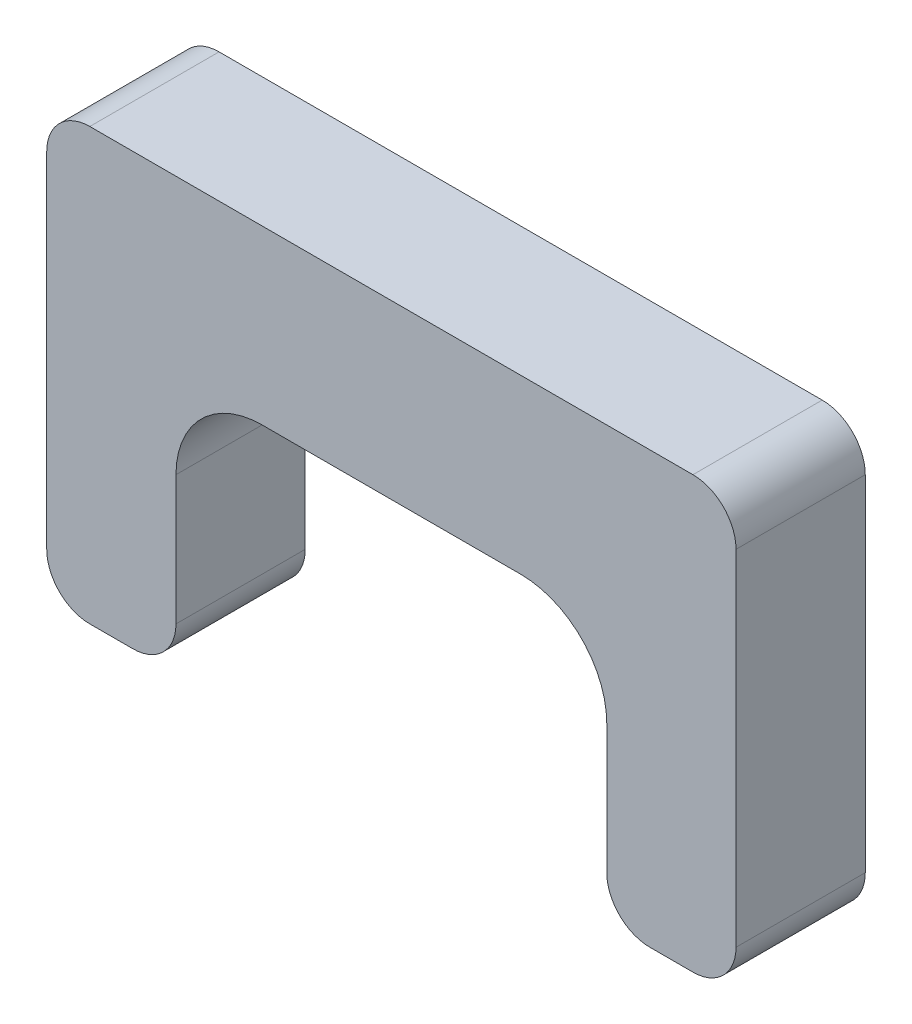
ISO-10303-21;
HEADER;
FILE_DESCRIPTION(('STEP AP214'),'2;1');
FILE_NAME('part.step','',(''),(''),'','','');
FILE_SCHEMA(('AUTOMOTIVE_DESIGN { 1 0 10303 214 1 1 1 1 }'));
ENDSEC;
DATA;
#1=APPLICATION_CONTEXT('core data for automotive mechanical design processes');
#2=APPLICATION_PROTOCOL_DEFINITION('international standard','automotive_design',2000,#1);
#3=PRODUCT_CONTEXT('',#1,'mechanical');
#4=PRODUCT('Part','Part','',(#3));
#5=PRODUCT_RELATED_PRODUCT_CATEGORY('part','',(#4));
#6=PRODUCT_DEFINITION_FORMATION('','',#4);
#7=PRODUCT_DEFINITION_CONTEXT('part definition',#1,'design');
#8=PRODUCT_DEFINITION('design','',#6,#7);
#9=PRODUCT_DEFINITION_SHAPE('','',#8);
#10=(LENGTH_UNIT() NAMED_UNIT(*) SI_UNIT(.MILLI.,.METRE.));
#11=(NAMED_UNIT(*) PLANE_ANGLE_UNIT() SI_UNIT($,.RADIAN.));
#12=(NAMED_UNIT(*) SI_UNIT($,.STERADIAN.) SOLID_ANGLE_UNIT());
#13=UNCERTAINTY_MEASURE_WITH_UNIT(LENGTH_MEASURE(1.E-05),#10,'distance_accuracy_value','');
#14=(GEOMETRIC_REPRESENTATION_CONTEXT(3) GLOBAL_UNCERTAINTY_ASSIGNED_CONTEXT((#13)) GLOBAL_UNIT_ASSIGNED_CONTEXT((#10,
#11,#12)) REPRESENTATION_CONTEXT('',''));
#15=CARTESIAN_POINT('',(0.,0.,0.));
#16=DIRECTION('',(0.,0.,1.));
#17=DIRECTION('',(1.,0.,0.));
#18=AXIS2_PLACEMENT_3D('',#15,#16,#17);
#19=CARTESIAN_POINT('',(-8.,-5.,3.));
#20=DIRECTION('',(0.,1.,0.));
#21=DIRECTION('',(0.,0.,1.));
#22=AXIS2_PLACEMENT_3D('',#19,#20,#21);
#23=PLANE('',#22);
#24=DIRECTION('',(1.,0.,0.));
#25=VECTOR('',#24,1.);
#26=CARTESIAN_POINT('',(-8.,-5.,0.));
#27=LINE('',#26,#25);
#28=CARTESIAN_POINT('',(6.,-5.,0.));
#29=VERTEX_POINT('',#28);
#30=CARTESIAN_POINT('',(7.,-5.,0.));
#31=VERTEX_POINT('',#30);
#32=EDGE_CURVE('E244',#29,#31,#27,.T.);
#33=ORIENTED_EDGE('',*,*,#32,.T.);
#34=DIRECTION('',(0.,0.,-1.));
#35=VECTOR('',#34,1.);
#36=CARTESIAN_POINT('',(7.,-5.,3.));
#37=LINE('',#36,#35);
#38=CARTESIAN_POINT('',(7.,-5.,3.));
#39=VERTEX_POINT('',#38);
#40=EDGE_CURVE('E43',#31,#39,#37,.F.);
#41=ORIENTED_EDGE('',*,*,#40,.T.);
#42=DIRECTION('',(1.,0.,0.));
#43=VECTOR('',#42,1.);
#44=CARTESIAN_POINT('',(-8.,-5.,3.));
#45=LINE('',#44,#43);
#46=CARTESIAN_POINT('',(6.,-5.,3.));
#47=VERTEX_POINT('',#46);
#48=EDGE_CURVE('E241',#47,#39,#45,.T.);
#49=ORIENTED_EDGE('',*,*,#48,.F.);
#50=DIRECTION('',(0.,0.,-1.));
#51=VECTOR('',#50,1.);
#52=CARTESIAN_POINT('',(6.,-5.,3.));
#53=LINE('',#52,#51);
#54=EDGE_CURVE('E235',#47,#29,#53,.T.);
#55=ORIENTED_EDGE('',*,*,#54,.T.);
#56=EDGE_LOOP('',(#33,#41,#49,#55));
#57=FACE_BOUND('',#56,.T.);
#58=ADVANCED_FACE('F35',(#57),#23,.F.);
#59=CARTESIAN_POINT('',(8.,5.,3.));
#60=DIRECTION('',(-1.,0.,0.));
#61=DIRECTION('',(0.,0.,1.));
#62=AXIS2_PLACEMENT_3D('',#59,#60,#61);
#63=PLANE('',#62);
#64=DIRECTION('',(0.,1.,0.));
#65=VECTOR('',#64,1.);
#66=CARTESIAN_POINT('',(8.,5.,3.));
#67=LINE('',#66,#65);
#68=CARTESIAN_POINT('',(8.,-4.,3.));
#69=VERTEX_POINT('',#68);
#70=CARTESIAN_POINT('',(8.,4.,3.));
#71=VERTEX_POINT('',#70);
#72=EDGE_CURVE('E259',#69,#71,#67,.T.);
#73=ORIENTED_EDGE('',*,*,#72,.F.);
#74=DIRECTION('',(0.,0.,-1.));
#75=VECTOR('',#74,1.);
#76=CARTESIAN_POINT('',(8.,-4.,3.));
#77=LINE('',#76,#75);
#78=CARTESIAN_POINT('',(8.,-4.,0.));
#79=VERTEX_POINT('',#78);
#80=EDGE_CURVE('E233',#69,#79,#77,.T.);
#81=ORIENTED_EDGE('',*,*,#80,.T.);
#82=DIRECTION('',(0.,1.,0.));
#83=VECTOR('',#82,1.);
#84=CARTESIAN_POINT('',(8.,5.,0.));
#85=LINE('',#84,#83);
#86=CARTESIAN_POINT('',(8.,4.,0.));
#87=VERTEX_POINT('',#86);
#88=EDGE_CURVE('E170',#79,#87,#85,.T.);
#89=ORIENTED_EDGE('',*,*,#88,.T.);
#90=DIRECTION('',(0.,0.,-1.));
#91=VECTOR('',#90,1.);
#92=CARTESIAN_POINT('',(8.,4.,3.));
#93=LINE('',#92,#91);
#94=EDGE_CURVE('E231',#87,#71,#93,.F.);
#95=ORIENTED_EDGE('',*,*,#94,.T.);
#96=EDGE_LOOP('',(#73,#81,#89,#95));
#97=FACE_BOUND('',#96,.T.);
#98=ADVANCED_FACE('F257',(#97),#63,.F.);
#99=CARTESIAN_POINT('',(-8.,5.,3.));
#100=DIRECTION('',(0.,-1.,0.));
#101=DIRECTION('',(0.,0.,-1.));
#102=AXIS2_PLACEMENT_3D('',#99,#100,#101);
#103=PLANE('',#102);
#104=DIRECTION('',(-1.,0.,0.));
#105=VECTOR('',#104,1.);
#106=CARTESIAN_POINT('',(-8.,5.,0.));
#107=LINE('',#106,#105);
#108=CARTESIAN_POINT('',(7.,5.,0.));
#109=VERTEX_POINT('',#108);
#110=CARTESIAN_POINT('',(-7.,5.,0.));
#111=VERTEX_POINT('',#110);
#112=EDGE_CURVE('E260',#109,#111,#107,.T.);
#113=ORIENTED_EDGE('',*,*,#112,.T.);
#114=DIRECTION('',(0.,0.,-1.));
#115=VECTOR('',#114,1.);
#116=CARTESIAN_POINT('',(-7.,5.,3.));
#117=LINE('',#116,#115);
#118=CARTESIAN_POINT('',(-7.,5.,3.));
#119=VERTEX_POINT('',#118);
#120=EDGE_CURVE('E229',#111,#119,#117,.F.);
#121=ORIENTED_EDGE('',*,*,#120,.T.);
#122=DIRECTION('',(-1.,0.,0.));
#123=VECTOR('',#122,1.);
#124=CARTESIAN_POINT('',(-8.,5.,3.));
#125=LINE('',#124,#123);
#126=CARTESIAN_POINT('',(7.,5.,3.));
#127=VERTEX_POINT('',#126);
#128=EDGE_CURVE('E273',#127,#119,#125,.T.);
#129=ORIENTED_EDGE('',*,*,#128,.F.);
#130=DIRECTION('',(0.,0.,-1.));
#131=VECTOR('',#130,1.);
#132=CARTESIAN_POINT('',(7.,5.,3.));
#133=LINE('',#132,#131);
#134=EDGE_CURVE('E226',#127,#109,#133,.T.);
#135=ORIENTED_EDGE('',*,*,#134,.T.);
#136=EDGE_LOOP('',(#113,#121,#129,#135));
#137=FACE_BOUND('',#136,.T.);
#138=ADVANCED_FACE('F327',(#137),#103,.F.);
#139=CARTESIAN_POINT('',(-8.,5.,3.));
#140=DIRECTION('',(1.,0.,0.));
#141=DIRECTION('',(0.,1.,0.));
#142=AXIS2_PLACEMENT_3D('',#139,#140,#141);
#143=PLANE('',#142);
#144=DIRECTION('',(0.,-1.,0.));
#145=VECTOR('',#144,1.);
#146=CARTESIAN_POINT('',(-8.,5.,0.));
#147=LINE('',#146,#145);
#148=CARTESIAN_POINT('',(-8.,4.,0.));
#149=VERTEX_POINT('',#148);
#150=CARTESIAN_POINT('',(-8.,-4.,0.));
#151=VERTEX_POINT('',#150);
#152=EDGE_CURVE('E263',#149,#151,#147,.T.);
#153=ORIENTED_EDGE('',*,*,#152,.T.);
#154=DIRECTION('',(0.,0.,-1.));
#155=VECTOR('',#154,1.);
#156=CARTESIAN_POINT('',(-8.,-4.,3.));
#157=LINE('',#156,#155);
#158=CARTESIAN_POINT('',(-8.,-4.,3.));
#159=VERTEX_POINT('',#158);
#160=EDGE_CURVE('E224',#151,#159,#157,.F.);
#161=ORIENTED_EDGE('',*,*,#160,.T.);
#162=DIRECTION('',(0.,-1.,0.));
#163=VECTOR('',#162,1.);
#164=CARTESIAN_POINT('',(-8.,5.,3.));
#165=LINE('',#164,#163);
#166=CARTESIAN_POINT('',(-8.,4.,3.));
#167=VERTEX_POINT('',#166);
#168=EDGE_CURVE('E253',#167,#159,#165,.T.);
#169=ORIENTED_EDGE('',*,*,#168,.F.);
#170=DIRECTION('',(0.,0.,-1.));
#171=VECTOR('',#170,1.);
#172=CARTESIAN_POINT('',(-8.,4.,3.));
#173=LINE('',#172,#171);
#174=EDGE_CURVE('E221',#167,#149,#173,.T.);
#175=ORIENTED_EDGE('',*,*,#174,.T.);
#176=EDGE_LOOP('',(#153,#161,#169,#175));
#177=FACE_BOUND('',#176,.T.);
#178=ADVANCED_FACE('F332',(#177),#143,.F.);
#179=CARTESIAN_POINT('',(-7.,-5.,0.));
#180=VERTEX_POINT('',#179);
#181=CARTESIAN_POINT('',(-6.,-5.,0.));
#182=VERTEX_POINT('',#181);
#183=EDGE_CURVE('E268',#180,#182,#27,.T.);
#184=ORIENTED_EDGE('',*,*,#183,.T.);
#185=DIRECTION('',(0.,0.,1.));
#186=VECTOR('',#185,1.);
#187=CARTESIAN_POINT('',(-6.,-5.,3.));
#188=LINE('',#187,#186);
#189=CARTESIAN_POINT('',(-6.,-5.,3.));
#190=VERTEX_POINT('',#189);
#191=EDGE_CURVE('E195',#182,#190,#188,.T.);
#192=ORIENTED_EDGE('',*,*,#191,.T.);
#193=CARTESIAN_POINT('',(-7.,-5.,3.));
#194=VERTEX_POINT('',#193);
#195=EDGE_CURVE('E179',#194,#190,#45,.T.);
#196=ORIENTED_EDGE('',*,*,#195,.F.);
#197=DIRECTION('',(0.,0.,-1.));
#198=VECTOR('',#197,1.);
#199=CARTESIAN_POINT('',(-7.,-5.,3.));
#200=LINE('',#199,#198);
#201=EDGE_CURVE('E192',#194,#180,#200,.T.);
#202=ORIENTED_EDGE('',*,*,#201,.T.);
#203=EDGE_LOOP('',(#184,#192,#196,#202));
#204=FACE_BOUND('',#203,.T.);
#205=ADVANCED_FACE('F292',(#204),#23,.F.);
#206=CARTESIAN_POINT('',(0.,0.,3.));
#207=DIRECTION('',(0.,0.,1.));
#208=DIRECTION('',(1.,0.,0.));
#209=AXIS2_PLACEMENT_3D('',#206,#207,#208);
#210=PLANE('',#209);
#211=ORIENTED_EDGE('',*,*,#195,.T.);
#212=CARTESIAN_POINT('',(-6.,-4.,3.));
#213=DIRECTION('',(0.,0.,1.));
#214=DIRECTION('',(1.,0.,0.));
#215=AXIS2_PLACEMENT_3D('',#212,#213,#214);
#216=CIRCLE('',#215,1.);
#217=CARTESIAN_POINT('',(-5.,-4.,3.));
#218=VERTEX_POINT('',#217);
#219=EDGE_CURVE('E208',#190,#218,#216,.T.);
#220=ORIENTED_EDGE('',*,*,#219,.T.);
#221=DIRECTION('',(0.,-1.,0.));
#222=VECTOR('',#221,1.);
#223=CARTESIAN_POINT('',(-5.,-11.,3.));
#224=LINE('',#223,#222);
#225=CARTESIAN_POINT('',(-5.,-0.999999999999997,3.));
#226=VERTEX_POINT('',#225);
#227=EDGE_CURVE('E279',#226,#218,#224,.T.);
#228=ORIENTED_EDGE('',*,*,#227,.F.);
#229=CARTESIAN_POINT('',(-3.,-0.999999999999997,3.));
#230=DIRECTION('',(0.,0.,1.));
#231=DIRECTION('',(1.,0.,0.));
#232=AXIS2_PLACEMENT_3D('',#229,#230,#231);
#233=CIRCLE('',#232,2.);
#234=CARTESIAN_POINT('',(-3.,1.,3.));
#235=VERTEX_POINT('',#234);
#236=EDGE_CURVE('E160',#226,#235,#233,.F.);
#237=ORIENTED_EDGE('',*,*,#236,.T.);
#238=DIRECTION('',(-1.,0.,0.));
#239=VECTOR('',#238,1.);
#240=CARTESIAN_POINT('',(-5.,1.,3.));
#241=LINE('',#240,#239);
#242=CARTESIAN_POINT('',(3.,1.,3.));
#243=VERTEX_POINT('',#242);
#244=EDGE_CURVE('E296',#243,#235,#241,.T.);
#245=ORIENTED_EDGE('',*,*,#244,.F.);
#246=CARTESIAN_POINT('',(3.,-0.999999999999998,3.));
#247=DIRECTION('',(0.,0.,1.));
#248=DIRECTION('',(1.,0.,0.));
#249=AXIS2_PLACEMENT_3D('',#246,#247,#248);
#250=CIRCLE('',#249,2.);
#251=CARTESIAN_POINT('',(5.,-0.999999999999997,3.));
#252=VERTEX_POINT('',#251);
#253=EDGE_CURVE('E159',#243,#252,#250,.F.);
#254=ORIENTED_EDGE('',*,*,#253,.T.);
#255=DIRECTION('',(0.,1.,0.));
#256=VECTOR('',#255,1.);
#257=CARTESIAN_POINT('',(5.,-11.,3.));
#258=LINE('',#257,#256);
#259=CARTESIAN_POINT('',(5.,-4.,3.));
#260=VERTEX_POINT('',#259);
#261=EDGE_CURVE('E299',#260,#252,#258,.T.);
#262=ORIENTED_EDGE('',*,*,#261,.F.);
#263=CARTESIAN_POINT('',(6.,-4.,3.));
#264=DIRECTION('',(0.,0.,1.));
#265=DIRECTION('',(1.,0.,0.));
#266=AXIS2_PLACEMENT_3D('',#263,#264,#265);
#267=CIRCLE('',#266,1.);
#268=EDGE_CURVE('E200',#260,#47,#267,.T.);
#269=ORIENTED_EDGE('',*,*,#268,.T.);
#270=ORIENTED_EDGE('',*,*,#48,.T.);
#271=CARTESIAN_POINT('',(7.,-4.,3.));
#272=DIRECTION('',(0.,0.,1.));
#273=DIRECTION('',(1.,0.,0.));
#274=AXIS2_PLACEMENT_3D('',#271,#272,#273);
#275=CIRCLE('',#274,1.);
#276=EDGE_CURVE('E202',#39,#69,#275,.T.);
#277=ORIENTED_EDGE('',*,*,#276,.T.);
#278=ORIENTED_EDGE('',*,*,#72,.T.);
#279=CARTESIAN_POINT('',(7.,4.,3.));
#280=DIRECTION('',(0.,0.,1.));
#281=DIRECTION('',(1.,0.,0.));
#282=AXIS2_PLACEMENT_3D('',#279,#280,#281);
#283=CIRCLE('',#282,1.);
#284=EDGE_CURVE('E198',#71,#127,#283,.T.);
#285=ORIENTED_EDGE('',*,*,#284,.T.);
#286=ORIENTED_EDGE('',*,*,#128,.T.);
#287=CARTESIAN_POINT('',(-7.,4.,3.));
#288=DIRECTION('',(0.,0.,1.));
#289=DIRECTION('',(1.,0.,0.));
#290=AXIS2_PLACEMENT_3D('',#287,#288,#289);
#291=CIRCLE('',#290,1.);
#292=EDGE_CURVE('E204',#119,#167,#291,.T.);
#293=ORIENTED_EDGE('',*,*,#292,.T.);
#294=ORIENTED_EDGE('',*,*,#168,.T.);
#295=CARTESIAN_POINT('',(-7.,-4.,3.));
#296=DIRECTION('',(0.,0.,1.));
#297=DIRECTION('',(1.,0.,0.));
#298=AXIS2_PLACEMENT_3D('',#295,#296,#297);
#299=CIRCLE('',#298,1.);
#300=EDGE_CURVE('E206',#159,#194,#299,.T.);
#301=ORIENTED_EDGE('',*,*,#300,.T.);
#302=EDGE_LOOP('',(#211,#220,#228,#237,#245,#254,#262,#269,#270,#277,#278,#285,#286,#293,#294,#301));
#303=FACE_BOUND('',#302,.T.);
#304=ADVANCED_FACE('F248',(#303),#210,.T.);
#305=CARTESIAN_POINT('',(0.,0.,0.));
#306=DIRECTION('',(0.,0.,1.));
#307=DIRECTION('',(1.,0.,0.));
#308=AXIS2_PLACEMENT_3D('',#305,#306,#307);
#309=PLANE('',#308);
#310=DIRECTION('',(0.,-1.,0.));
#311=VECTOR('',#310,1.);
#312=CARTESIAN_POINT('',(-5.,-11.,0.));
#313=LINE('',#312,#311);
#314=CARTESIAN_POINT('',(-5.,-0.999999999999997,0.));
#315=VERTEX_POINT('',#314);
#316=CARTESIAN_POINT('',(-5.,-4.,0.));
#317=VERTEX_POINT('',#316);
#318=EDGE_CURVE('E152',#315,#317,#313,.T.);
#319=ORIENTED_EDGE('',*,*,#318,.T.);
#320=CARTESIAN_POINT('',(-6.,-4.,0.));
#321=DIRECTION('',(0.,0.,1.));
#322=DIRECTION('',(1.,0.,0.));
#323=AXIS2_PLACEMENT_3D('',#320,#321,#322);
#324=CIRCLE('',#323,1.);
#325=EDGE_CURVE('E219',#317,#182,#324,.F.);
#326=ORIENTED_EDGE('',*,*,#325,.T.);
#327=ORIENTED_EDGE('',*,*,#183,.F.);
#328=CARTESIAN_POINT('',(-7.,-4.,0.));
#329=DIRECTION('',(0.,0.,1.));
#330=DIRECTION('',(1.,0.,0.));
#331=AXIS2_PLACEMENT_3D('',#328,#329,#330);
#332=CIRCLE('',#331,1.);
#333=EDGE_CURVE('E217',#180,#151,#332,.F.);
#334=ORIENTED_EDGE('',*,*,#333,.T.);
#335=ORIENTED_EDGE('',*,*,#152,.F.);
#336=CARTESIAN_POINT('',(-7.,4.,0.));
#337=DIRECTION('',(0.,0.,1.));
#338=DIRECTION('',(1.,0.,0.));
#339=AXIS2_PLACEMENT_3D('',#336,#337,#338);
#340=CIRCLE('',#339,1.);
#341=EDGE_CURVE('E215',#149,#111,#340,.F.);
#342=ORIENTED_EDGE('',*,*,#341,.T.);
#343=ORIENTED_EDGE('',*,*,#112,.F.);
#344=CARTESIAN_POINT('',(7.,4.,0.));
#345=DIRECTION('',(0.,0.,1.));
#346=DIRECTION('',(1.,0.,0.));
#347=AXIS2_PLACEMENT_3D('',#344,#345,#346);
#348=CIRCLE('',#347,1.);
#349=EDGE_CURVE('E50',#109,#87,#348,.F.);
#350=ORIENTED_EDGE('',*,*,#349,.T.);
#351=ORIENTED_EDGE('',*,*,#88,.F.);
#352=CARTESIAN_POINT('',(7.,-4.,0.));
#353=DIRECTION('',(0.,0.,1.));
#354=DIRECTION('',(1.,0.,0.));
#355=AXIS2_PLACEMENT_3D('',#352,#353,#354);
#356=CIRCLE('',#355,1.);
#357=EDGE_CURVE('E58',#79,#31,#356,.F.);
#358=ORIENTED_EDGE('',*,*,#357,.T.);
#359=ORIENTED_EDGE('',*,*,#32,.F.);
#360=CARTESIAN_POINT('',(6.,-4.,0.));
#361=DIRECTION('',(0.,0.,1.));
#362=DIRECTION('',(1.,0.,0.));
#363=AXIS2_PLACEMENT_3D('',#360,#361,#362);
#364=CIRCLE('',#363,1.);
#365=CARTESIAN_POINT('',(5.,-4.,0.));
#366=VERTEX_POINT('',#365);
#367=EDGE_CURVE('E212',#29,#366,#364,.F.);
#368=ORIENTED_EDGE('',*,*,#367,.T.);
#369=DIRECTION('',(0.,1.,0.));
#370=VECTOR('',#369,1.);
#371=CARTESIAN_POINT('',(5.,0.,0.));
#372=LINE('',#371,#370);
#373=CARTESIAN_POINT('',(5.,-0.999999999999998,0.));
#374=VERTEX_POINT('',#373);
#375=EDGE_CURVE('E174',#366,#374,#372,.T.);
#376=ORIENTED_EDGE('',*,*,#375,.T.);
#377=CARTESIAN_POINT('',(3.,-0.999999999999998,0.));
#378=DIRECTION('',(0.,0.,1.));
#379=DIRECTION('',(1.,0.,0.));
#380=AXIS2_PLACEMENT_3D('',#377,#378,#379);
#381=CIRCLE('',#380,2.);
#382=CARTESIAN_POINT('',(3.,1.,0.));
#383=VERTEX_POINT('',#382);
#384=EDGE_CURVE('E190',#374,#383,#381,.T.);
#385=ORIENTED_EDGE('',*,*,#384,.T.);
#386=DIRECTION('',(-1.,0.,0.));
#387=VECTOR('',#386,1.);
#388=CARTESIAN_POINT('',(-5.,1.,0.));
#389=LINE('',#388,#387);
#390=CARTESIAN_POINT('',(-3.,1.,0.));
#391=VERTEX_POINT('',#390);
#392=EDGE_CURVE('E155',#383,#391,#389,.T.);
#393=ORIENTED_EDGE('',*,*,#392,.T.);
#394=CARTESIAN_POINT('',(-3.,-0.999999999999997,0.));
#395=DIRECTION('',(0.,0.,1.));
#396=DIRECTION('',(1.,0.,0.));
#397=AXIS2_PLACEMENT_3D('',#394,#395,#396);
#398=CIRCLE('',#397,2.);
#399=EDGE_CURVE('E149',#391,#315,#398,.T.);
#400=ORIENTED_EDGE('',*,*,#399,.T.);
#401=EDGE_LOOP('',(#319,#326,#327,#334,#335,#342,#343,#350,#351,#358,#359,#368,#376,#385,#393,#400));
#402=FACE_BOUND('',#401,.T.);
#403=ADVANCED_FACE('F151',(#402),#309,.F.);
#404=CARTESIAN_POINT('',(5.,-11.,0.));
#405=DIRECTION('',(1.,0.,0.));
#406=DIRECTION('',(0.,1.,0.));
#407=AXIS2_PLACEMENT_3D('',#404,#405,#406);
#408=PLANE('',#407);
#409=ORIENTED_EDGE('',*,*,#375,.F.);
#410=DIRECTION('',(0.,0.,-1.));
#411=VECTOR('',#410,1.);
#412=CARTESIAN_POINT('',(5.,-4.,0.));
#413=LINE('',#412,#411);
#414=EDGE_CURVE('E11',#366,#260,#413,.F.);
#415=ORIENTED_EDGE('',*,*,#414,.T.);
#416=ORIENTED_EDGE('',*,*,#261,.T.);
#417=DIRECTION('',(0.,0.,1.));
#418=VECTOR('',#417,1.);
#419=CARTESIAN_POINT('',(5.,-0.999999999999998,0.));
#420=LINE('',#419,#418);
#421=EDGE_CURVE('E184',#252,#374,#420,.F.);
#422=ORIENTED_EDGE('',*,*,#421,.T.);
#423=EDGE_LOOP('',(#409,#415,#416,#422));
#424=FACE_BOUND('',#423,.T.);
#425=ADVANCED_FACE('F305',(#424),#408,.F.);
#426=CARTESIAN_POINT('',(-5.,-11.,0.));
#427=DIRECTION('',(-1.,0.,0.));
#428=DIRECTION('',(0.,-1.,0.));
#429=AXIS2_PLACEMENT_3D('',#426,#427,#428);
#430=PLANE('',#429);
#431=ORIENTED_EDGE('',*,*,#227,.T.);
#432=DIRECTION('',(0.,0.,1.));
#433=VECTOR('',#432,1.);
#434=CARTESIAN_POINT('',(-5.,-4.,0.));
#435=LINE('',#434,#433);
#436=EDGE_CURVE('E169',#218,#317,#435,.F.);
#437=ORIENTED_EDGE('',*,*,#436,.T.);
#438=ORIENTED_EDGE('',*,*,#318,.F.);
#439=DIRECTION('',(0.,0.,1.));
#440=VECTOR('',#439,1.);
#441=CARTESIAN_POINT('',(-5.,-0.999999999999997,3.));
#442=LINE('',#441,#440);
#443=EDGE_CURVE('E166',#315,#226,#442,.T.);
#444=ORIENTED_EDGE('',*,*,#443,.T.);
#445=EDGE_LOOP('',(#431,#437,#438,#444));
#446=FACE_BOUND('',#445,.T.);
#447=ADVANCED_FACE('F165',(#446),#430,.F.);
#448=CARTESIAN_POINT('',(-5.,1.,0.));
#449=DIRECTION('',(0.,1.,0.));
#450=DIRECTION('',(-1.,0.,0.));
#451=AXIS2_PLACEMENT_3D('',#448,#449,#450);
#452=PLANE('',#451);
#453=ORIENTED_EDGE('',*,*,#244,.T.);
#454=DIRECTION('',(0.,0.,1.));
#455=VECTOR('',#454,1.);
#456=CARTESIAN_POINT('',(-3.,1.,0.));
#457=LINE('',#456,#455);
#458=EDGE_CURVE('E177',#235,#391,#457,.F.);
#459=ORIENTED_EDGE('',*,*,#458,.T.);
#460=ORIENTED_EDGE('',*,*,#392,.F.);
#461=DIRECTION('',(0.,0.,1.));
#462=VECTOR('',#461,1.);
#463=CARTESIAN_POINT('',(3.,1.,3.));
#464=LINE('',#463,#462);
#465=EDGE_CURVE('E173',#383,#243,#464,.T.);
#466=ORIENTED_EDGE('',*,*,#465,.T.);
#467=EDGE_LOOP('',(#453,#459,#460,#466));
#468=FACE_BOUND('',#467,.T.);
#469=ADVANCED_FACE('F312',(#468),#452,.F.);
#470=CARTESIAN_POINT('',(-3.,-0.999999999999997,0.));
#471=DIRECTION('',(0.,0.,-1.));
#472=DIRECTION('',(-1.,0.,0.));
#473=AXIS2_PLACEMENT_3D('',#470,#471,#472);
#474=CYLINDRICAL_SURFACE('',#473,2.);
#475=ORIENTED_EDGE('',*,*,#399,.F.);
#476=ORIENTED_EDGE('',*,*,#458,.F.);
#477=ORIENTED_EDGE('',*,*,#236,.F.);
#478=ORIENTED_EDGE('',*,*,#443,.F.);
#479=EDGE_LOOP('',(#475,#476,#477,#478));
#480=FACE_BOUND('',#479,.T.);
#481=ADVANCED_FACE('F172',(#480),#474,.F.);
#482=CARTESIAN_POINT('',(3.,-0.999999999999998,0.));
#483=DIRECTION('',(0.,0.,-1.));
#484=DIRECTION('',(-1.,0.,0.));
#485=AXIS2_PLACEMENT_3D('',#482,#483,#484);
#486=CYLINDRICAL_SURFACE('',#485,2.);
#487=ORIENTED_EDGE('',*,*,#384,.F.);
#488=ORIENTED_EDGE('',*,*,#421,.F.);
#489=ORIENTED_EDGE('',*,*,#253,.F.);
#490=ORIENTED_EDGE('',*,*,#465,.F.);
#491=EDGE_LOOP('',(#487,#488,#489,#490));
#492=FACE_BOUND('',#491,.T.);
#493=ADVANCED_FACE('F311',(#492),#486,.F.);
#494=CARTESIAN_POINT('',(-6.,-4.,3.));
#495=DIRECTION('',(0.,0.,1.));
#496=DIRECTION('',(1.,0.,0.));
#497=AXIS2_PLACEMENT_3D('',#494,#495,#496);
#498=CYLINDRICAL_SURFACE('',#497,1.);
#499=ORIENTED_EDGE('',*,*,#325,.F.);
#500=ORIENTED_EDGE('',*,*,#436,.F.);
#501=ORIENTED_EDGE('',*,*,#219,.F.);
#502=ORIENTED_EDGE('',*,*,#191,.F.);
#503=EDGE_LOOP('',(#499,#500,#501,#502));
#504=FACE_BOUND('',#503,.T.);
#505=ADVANCED_FACE('F295',(#504),#498,.T.);
#506=CARTESIAN_POINT('',(-7.,-4.,3.));
#507=DIRECTION('',(0.,0.,-1.));
#508=DIRECTION('',(-1.,0.,0.));
#509=AXIS2_PLACEMENT_3D('',#506,#507,#508);
#510=CYLINDRICAL_SURFACE('',#509,1.);
#511=ORIENTED_EDGE('',*,*,#300,.F.);
#512=ORIENTED_EDGE('',*,*,#160,.F.);
#513=ORIENTED_EDGE('',*,*,#333,.F.);
#514=ORIENTED_EDGE('',*,*,#201,.F.);
#515=EDGE_LOOP('',(#511,#512,#513,#514));
#516=FACE_BOUND('',#515,.T.);
#517=ADVANCED_FACE('F291',(#516),#510,.T.);
#518=CARTESIAN_POINT('',(-7.,4.,3.));
#519=DIRECTION('',(0.,0.,-1.));
#520=DIRECTION('',(-1.,0.,0.));
#521=AXIS2_PLACEMENT_3D('',#518,#519,#520);
#522=CYLINDRICAL_SURFACE('',#521,1.);
#523=ORIENTED_EDGE('',*,*,#292,.F.);
#524=ORIENTED_EDGE('',*,*,#120,.F.);
#525=ORIENTED_EDGE('',*,*,#341,.F.);
#526=ORIENTED_EDGE('',*,*,#174,.F.);
#527=EDGE_LOOP('',(#523,#524,#525,#526));
#528=FACE_BOUND('',#527,.T.);
#529=ADVANCED_FACE('F350',(#528),#522,.T.);
#530=CARTESIAN_POINT('',(7.,-4.,3.));
#531=DIRECTION('',(0.,0.,-1.));
#532=DIRECTION('',(-1.,0.,0.));
#533=AXIS2_PLACEMENT_3D('',#530,#531,#532);
#534=CYLINDRICAL_SURFACE('',#533,1.);
#535=ORIENTED_EDGE('',*,*,#276,.F.);
#536=ORIENTED_EDGE('',*,*,#40,.F.);
#537=ORIENTED_EDGE('',*,*,#357,.F.);
#538=ORIENTED_EDGE('',*,*,#80,.F.);
#539=EDGE_LOOP('',(#535,#536,#537,#538));
#540=FACE_BOUND('',#539,.T.);
#541=ADVANCED_FACE('F255',(#540),#534,.T.);
#542=CARTESIAN_POINT('',(6.,-4.,3.));
#543=DIRECTION('',(0.,0.,-1.));
#544=DIRECTION('',(-1.,0.,0.));
#545=AXIS2_PLACEMENT_3D('',#542,#543,#544);
#546=CYLINDRICAL_SURFACE('',#545,1.);
#547=ORIENTED_EDGE('',*,*,#268,.F.);
#548=ORIENTED_EDGE('',*,*,#414,.F.);
#549=ORIENTED_EDGE('',*,*,#367,.F.);
#550=ORIENTED_EDGE('',*,*,#54,.F.);
#551=EDGE_LOOP('',(#547,#548,#549,#550));
#552=FACE_BOUND('',#551,.T.);
#553=ADVANCED_FACE('F355',(#552),#546,.T.);
#554=CARTESIAN_POINT('',(7.,4.,3.));
#555=DIRECTION('',(0.,0.,-1.));
#556=DIRECTION('',(-1.,0.,0.));
#557=AXIS2_PLACEMENT_3D('',#554,#555,#556);
#558=CYLINDRICAL_SURFACE('',#557,1.);
#559=ORIENTED_EDGE('',*,*,#284,.F.);
#560=ORIENTED_EDGE('',*,*,#94,.F.);
#561=ORIENTED_EDGE('',*,*,#349,.F.);
#562=ORIENTED_EDGE('',*,*,#134,.F.);
#563=EDGE_LOOP('',(#559,#560,#561,#562));
#564=FACE_BOUND('',#563,.T.);
#565=ADVANCED_FACE('F37',(#564),#558,.T.);
#566=CLOSED_SHELL('',(#58,#98,#138,#178,#205,#304,#403,#425,#447,#469,#481,#493,#505,#517,#529,
#541,#553,#565));
#567=MANIFOLD_SOLID_BREP('B2',#566);
#568=ADVANCED_BREP_SHAPE_REPRESENTATION('',(#18,#567),#14);
#569=SHAPE_DEFINITION_REPRESENTATION(#9,#568);
ENDSEC;
END-ISO-10303-21;
